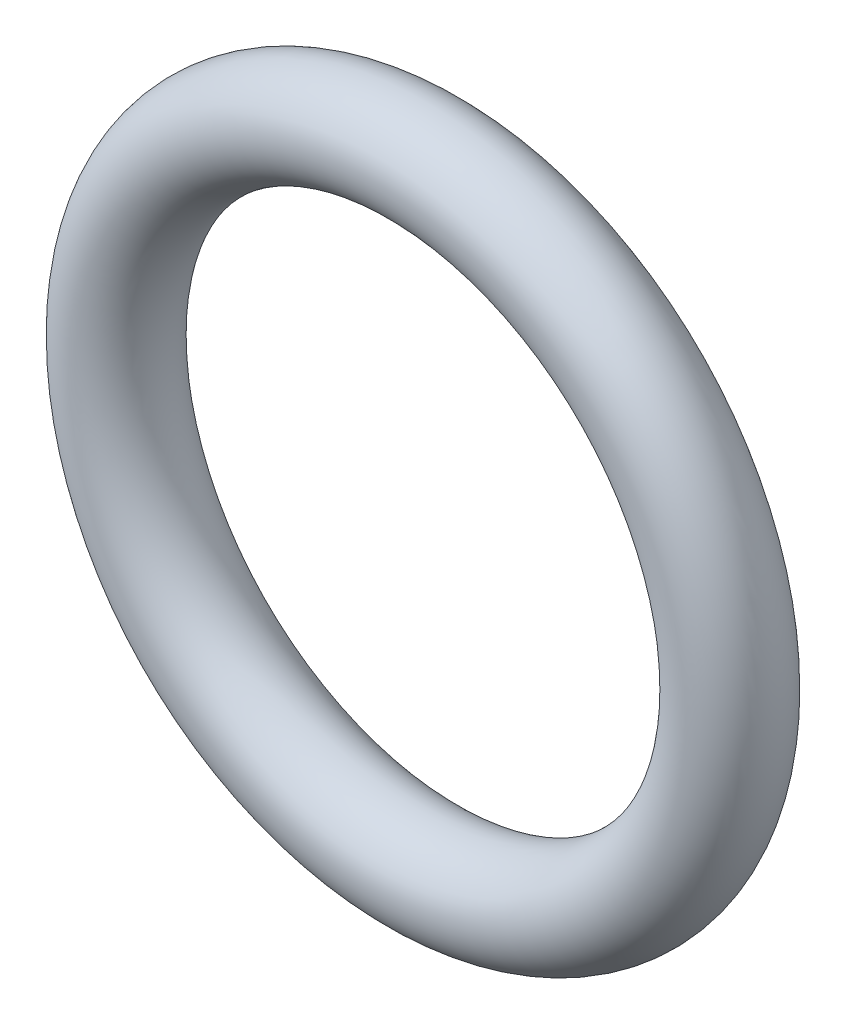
from build123d import *

# Parameters (mm, degrees)
SKETCH1_R = 0.889


with BuildPart() as part:
    # Sketch1 → Revolve1 (revolve)
    with BuildSketch(Plane(origin=(0, 0, 0), x_dir=(0, -1, 0), z_dir=(1, 0, 0)), mode=Mode.PRIVATE) as revolve1_sk:
        with Locations((5.5118, 0)):
            Circle(SKETCH1_R)
    revolve(revolve1_sk.sketch.rotate(Axis((0, 0, 0.889), (0, 0, -1)), 270), axis=Axis((0, 0, 0.889), (0, 0, -1)))


solid = part.part
